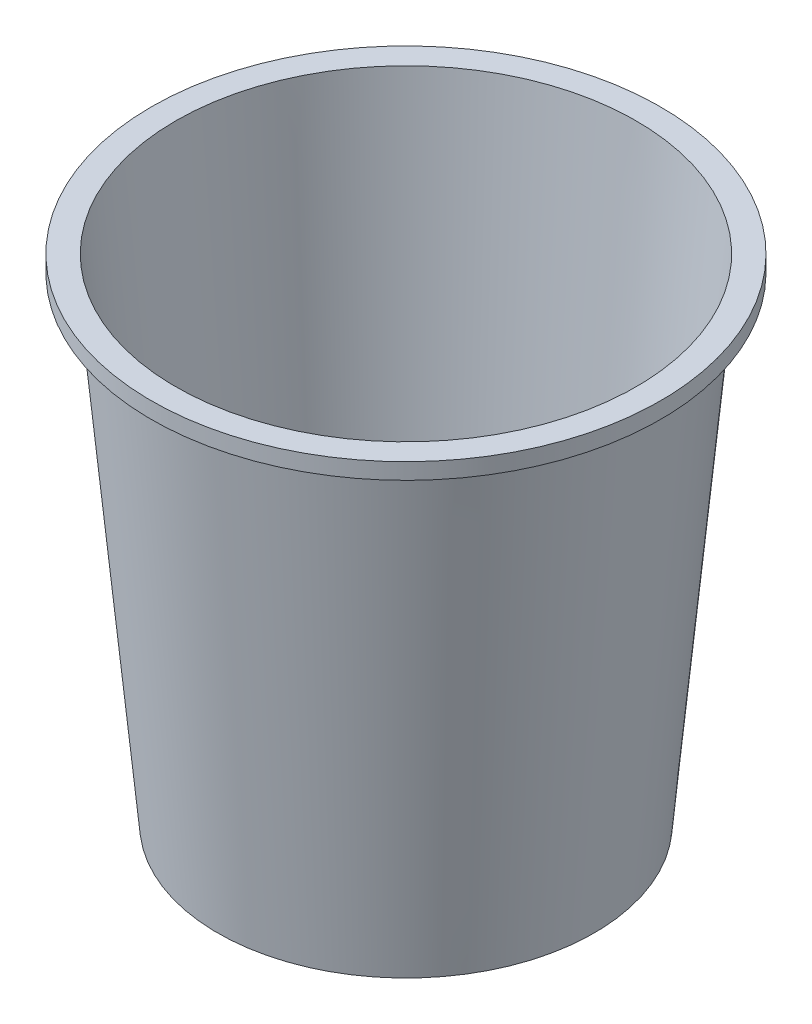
from build123d import *


with BuildPart() as part:
    # Sketch1 → Revolve1 (revolve)
    with BuildSketch(Plane.XY, mode=Mode.PRIVATE) as revolve1_sk:
        Polygon((0, -64.208047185), (22.711766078, -64.208047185), (22.245664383, -69.208047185), (23.25, -69.208047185), (28.75, -10.208047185), (31.434272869, -10.208047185), (31.434272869, -8.208047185), (28.434272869, -8.208047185), (23.260544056, -63.708047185), (0, -63.708047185), align=None)
    revolve(revolve1_sk.sketch.rotate(Axis((0, 0, 0), (0, -1, 0)), 180), axis=Axis((0, 0, 0), (0, -1, 0)))


solid = part.part
